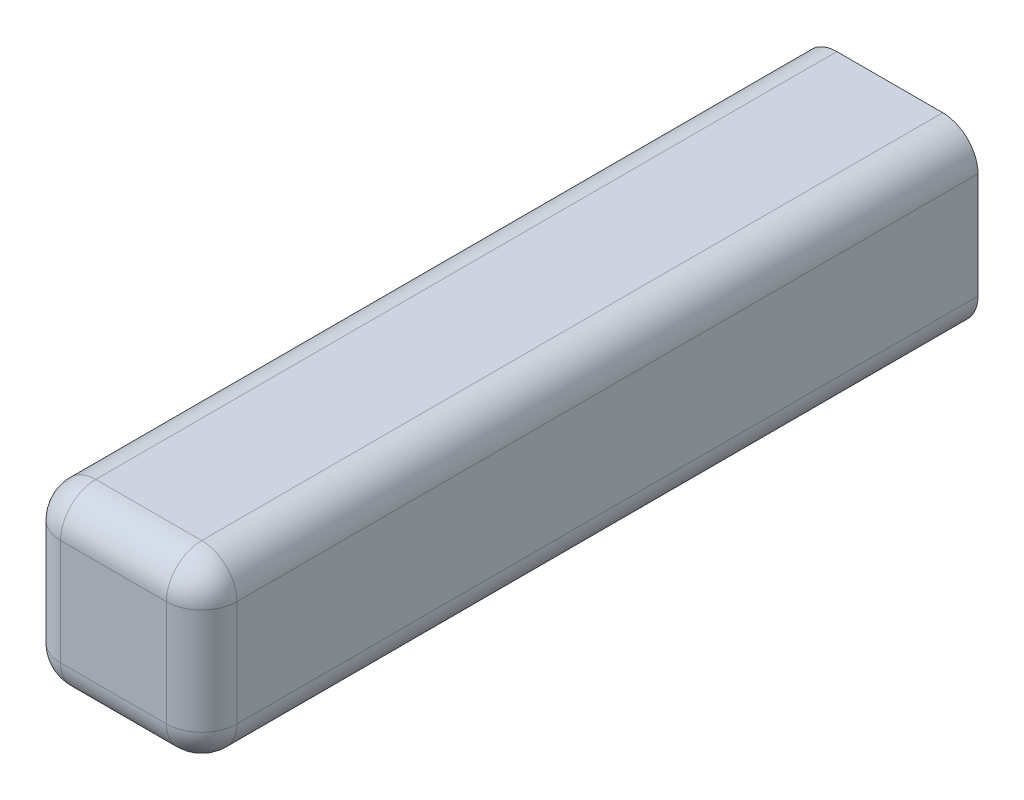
from build123d import *

# Parameters (mm, degrees)
SKIZZE2_W                       = 5
SKIZZE2_H                       = 5
AUFSATZ_LINEAR_AUSTRAGEN2_DEPTH = 22
SKIZZE4_W                       = 2
SKIZZE4_H                       = 2
SCHNITT_LINEAR_AUSTRAGEN1_DEPTH = 19
VERRUNDUNG1_R                   = 1


with BuildPart() as part:
    # Skizze2 → Aufsatz-Linear austragen2 (new body)
    with BuildSketch(Plane.XY):
        with Locations((2.5, 2.5)):
            Rectangle(SKIZZE2_W, SKIZZE2_H)
    extrude(amount=AUFSATZ_LINEAR_AUSTRAGEN2_DEPTH)

    # Skizze4 → Schnitt-Linear austragen1 (cut)
    with BuildSketch(Plane(origin=(0, 0, 0), x_dir=(-1, 0, 0), z_dir=(0, 0, -1))):
        with Locations((-2.5, 2.5)):
            Rectangle(SKIZZE4_W, SKIZZE4_H)
    extrude(amount=-SCHNITT_LINEAR_AUSTRAGEN1_DEPTH, mode=Mode.SUBTRACT)

    # Verrundung1
    verrundung1_edges = [part.edges().sort_by_distance(p)[0] for p in [
        (5, 2.5, 22),
        (2.5, 5, 22),
        (3.5, 2.5, 0),
        (2.5, 1.5, 0),
        (1.5, 2.5, 0),
        (2.5, 3.5, 0),
        (0, 2.5, 22),
        (0, 5, 11),
        (5, 5, 11),
        (5, 0, 11),
        (0, 0, 11),
        (2.5, 0, 22),
    ]]
    fillet(verrundung1_edges, radius=VERRUNDUNG1_R)


solid = part.part
